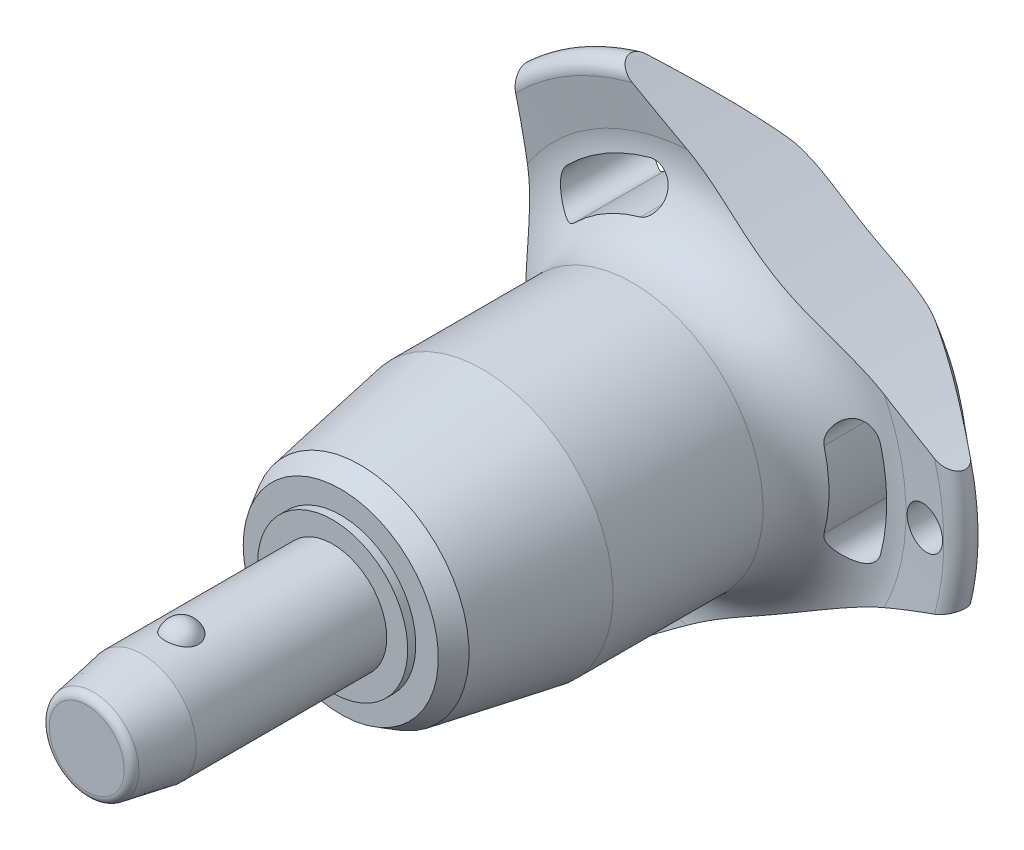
from build123d import *

# Parameters (mm, degrees)
SKETCH1_R           = 4
BOSS_EXTRUDE1_DEPTH = 10
SKETCH2_R           = 3.4
BOSS_EXTRUDE2_DEPTH = 33.3
BOSS_EXTRUDE3_START = 8.2
SKETCH1_2_R         = 4
BOSS_EXTRUDE3_DEPTH = 8.2
CHAMFER1_SIZE       = 4.1
CHAMFER1_SIZE2      = 0.722940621
FILLET1_R           = 0.6
SKETCH6_R           = 102.8
CUT_EXTRUDE1_DEPTH  = 52.415192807
CIRPATTERN1_COUNT   = 3
SKETCH7_R           = 1.5
CUT_EXTRUDE2_DEPTH  = 52.099652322


with BuildPart() as part:
    # Sketch1 → Boss-Extrude1 (new body)
    with BuildSketch(Plane.XY):
        Circle(SKETCH1_R)
    extrude(amount=-BOSS_EXTRUDE1_DEPTH)

    # Sketch2 → Boss-Extrude2 (add)
    with BuildSketch(Plane(origin=(0, 0, -10), x_dir=(-1, 0, 0), z_dir=(0, 0, -1))):
        Circle(SKETCH2_R)
    extrude(amount=BOSS_EXTRUDE2_DEPTH)

    # Sketch3 → Revolve1 (revolve)
    with BuildSketch(Plane(origin=(0, 0, 0), x_dir=(0, 0, -1), z_dir=(1, 0, 0))):
        with BuildLine():
            Line((-1.2, 4.8), (-1.2, 2.2))
            ThreePointArc((-1.2, 2.2), (0.1, 3.5), (-1.2, 4.8))
        make_face()
        with BuildLine():
            Line((-1.2, -2.2), (-1.2, -4.8))
            ThreePointArc((-1.2, -4.8), (0.1, -3.5), (-1.2, -2.2))
        make_face()
    revolve(axis=Axis((0, -2.2, 1.2), (0, 1, 0)))

    # Sketch1_2 → Boss-Extrude3 (add)
    with BuildSketch(Plane.XY.offset(BOSS_EXTRUDE3_START)):
        Circle(SKETCH1_2_R)
    extrude(amount=-BOSS_EXTRUDE3_DEPTH)

    # Chamfer1
    chamfer1_edges = [part.edges().sort_by_distance(p)[0] for p in [
        (-4, 0, 8.2),
    ]]
    chamfer1_side = [part.faces().sort_by_distance(p)[0] for p in [
        (-4, 0, -0.9),
    ]]
    chamfer(chamfer1_edges, length=CHAMFER1_SIZE, length2=CHAMFER1_SIZE2, reference=chamfer1_side[0])

    # Fillet1
    fillet1_edges = [part.edges().sort_by_distance(p)[0] for p in [
        (-3.277059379, 0, 8.2),
        (3.4, 0, -43.3),
    ]]
    fillet(fillet1_edges, radius=FILLET1_R)

    # Sketch4 → Revolve2 (revolve)
    with BuildSketch(Plane(origin=(0, 0, 0), x_dir=(0, 0, -1), z_dir=(1, 0, 0)), mode=Mode.PRIVATE) as revolve2_sk:
        Polygon((10, 0), (10, 5.554101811), (10.6, 5.554101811), (10.6, 7.220004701), (12.042714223, 8.052956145), (21.1, 9.65), (32.2, 9.65), (32.2, 0), align=None)
    revolve(revolve2_sk.sketch.rotate(Axis((0, 0, -32.2), (0, 0, 1)), 90), axis=Axis((0, 0, -32.2), (0, 0, 1)))

    # Sketch5 → Revolve3 (revolve)
    with BuildSketch(Plane(origin=(0, 0, 0), x_dir=(0, 0, -1), z_dir=(1, 0, 0)), mode=Mode.PRIVATE) as revolve3_sk:
        with BuildLine():
            Line((37.16082631, 15.274661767), (36.757834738, 18.475067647))
            ThreePointArc((36.757834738, 18.475067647), (37.349836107, 19.516443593), (38.516044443, 19.24278761))
            Line((38.516044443, 19.24278761), (42.835691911, 14.094832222))
            ThreePointArc((42.835691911, 14.094832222), (43.3, 12.689260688), (42.67067517, 11.349423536))
            ThreePointArc((42.67067517, 11.349423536), (39.033110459, 6.185112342), (37.75, 0))
            Line((37.75, 0), (32.2, 0))
            Line((32.2, 0), (32.2, 9.65))
            ThreePointArc((32.2, 9.65), (35.949887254, 11.342683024), (37.16082631, 15.274661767))
        make_face()
    revolve(revolve3_sk.sketch.rotate(Axis((0, 0, -37.75), (0, 0, 1)), 90), axis=Axis((0, 0, -37.75), (0, 0, 1)))

    # Sketch6 → Cut-Extrude1 (cut, through all)
    with BuildSketch(Plane.XY):
        with Locations((-115.2, 0)):
            Circle(SKETCH6_R)
        with BuildLine():
            ThreePointArc((13.411913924, -3.529271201), (13.868496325, 0), (13.411913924, 3.529271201))
            ThreePointArc((13.411913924, 3.529271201), (11.694200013, 4.531299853), (10.692171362, 2.813585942))
            ThreePointArc((10.692171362, 2.813585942), (11.056165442, 0), (10.692171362, -2.813585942))
            ThreePointArc((10.692171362, -2.813585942), (11.694200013, -4.531299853), (13.411913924, -3.529271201))
        make_face()
    cut_extrude1 = extrude(amount=-CUT_EXTRUDE1_DEPTH, mode=Mode.SUBTRACT)

    # CirPattern1: Cut-Extrude1 ×3 about axis
    cirpattern1_axis = Axis((0, 0, 0), (0, 0, 1))
    for i in range(1, CIRPATTERN1_COUNT):
        add(cut_extrude1.rotate(cirpattern1_axis, i * 360 / CIRPATTERN1_COUNT), mode=Mode.SUBTRACT)

    # Sketch7 → Cut-Extrude2 (cut, through all)
    with BuildSketch(Plane.XY):
        with Locations(Location((16.868496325, 0, 0), (0, 0, 225.467095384))):
            Circle(SKETCH7_R)
    extrude(amount=-CUT_EXTRUDE2_DEPTH, mode=Mode.SUBTRACT)


solid = part.part
